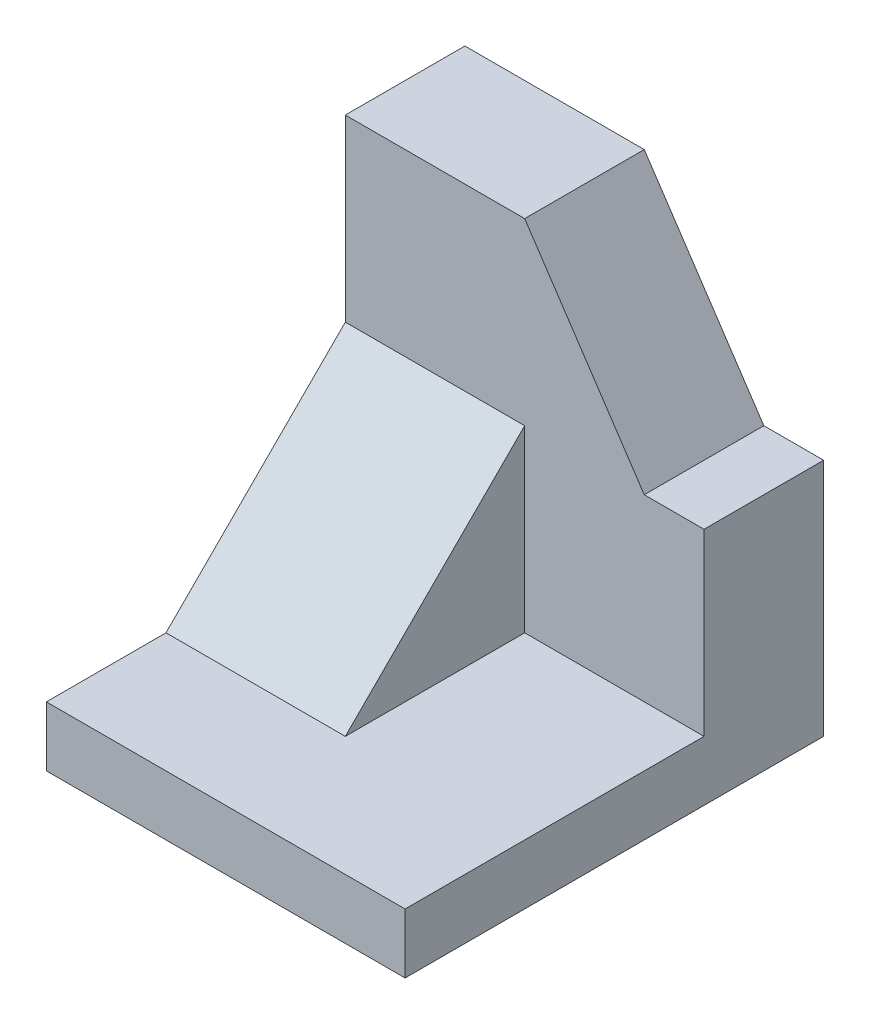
ISO-10303-21;
HEADER;
FILE_DESCRIPTION(('STEP AP214'),'2;1');
FILE_NAME('part.step','',(''),(''),'','','');
FILE_SCHEMA(('AUTOMOTIVE_DESIGN { 1 0 10303 214 1 1 1 1 }'));
ENDSEC;
DATA;
#1=APPLICATION_CONTEXT('core data for automotive mechanical design processes');
#2=APPLICATION_PROTOCOL_DEFINITION('international standard','automotive_design',2000,#1);
#3=PRODUCT_CONTEXT('',#1,'mechanical');
#4=PRODUCT('Part','Part','',(#3));
#5=PRODUCT_RELATED_PRODUCT_CATEGORY('part','',(#4));
#6=PRODUCT_DEFINITION_FORMATION('','',#4);
#7=PRODUCT_DEFINITION_CONTEXT('part definition',#1,'design');
#8=PRODUCT_DEFINITION('design','',#6,#7);
#9=PRODUCT_DEFINITION_SHAPE('','',#8);
#10=(LENGTH_UNIT() NAMED_UNIT(*) SI_UNIT(.MILLI.,.METRE.));
#11=(NAMED_UNIT(*) PLANE_ANGLE_UNIT() SI_UNIT($,.RADIAN.));
#12=(NAMED_UNIT(*) SI_UNIT($,.STERADIAN.) SOLID_ANGLE_UNIT());
#13=UNCERTAINTY_MEASURE_WITH_UNIT(LENGTH_MEASURE(1.E-05),#10,'distance_accuracy_value','');
#14=(GEOMETRIC_REPRESENTATION_CONTEXT(3) GLOBAL_UNCERTAINTY_ASSIGNED_CONTEXT((#13)) GLOBAL_UNIT_ASSIGNED_CONTEXT((#10,
#11,#12)) REPRESENTATION_CONTEXT('',''));
#15=CARTESIAN_POINT('',(0.,0.,0.));
#16=DIRECTION('',(0.,0.,1.));
#17=DIRECTION('',(1.,0.,0.));
#18=AXIS2_PLACEMENT_3D('',#15,#16,#17);
#19=CARTESIAN_POINT('',(-30.,35.,35.));
#20=DIRECTION('',(1.,0.,0.));
#21=DIRECTION('',(0.,1.,0.));
#22=AXIS2_PLACEMENT_3D('',#19,#20,#21);
#23=PLANE('',#22);
#24=DIRECTION('',(0.,0.707106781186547,-0.707106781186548));
#25=VECTOR('',#24,1.);
#26=CARTESIAN_POINT('',(-30.,-25.,15.));
#27=LINE('',#26,#25);
#28=CARTESIAN_POINT('',(-30.,-25.,15.));
#29=VERTEX_POINT('',#28);
#30=CARTESIAN_POINT('',(-30.,5.,-15.));
#31=VERTEX_POINT('',#30);
#32=EDGE_CURVE('E160',#29,#31,#27,.T.);
#33=ORIENTED_EDGE('',*,*,#32,.T.);
#34=DIRECTION('',(0.,1.,0.));
#35=VECTOR('',#34,1.);
#36=CARTESIAN_POINT('',(-30.,35.,-15.));
#37=LINE('',#36,#35);
#38=CARTESIAN_POINT('',(-30.,35.,-15.));
#39=VERTEX_POINT('',#38);
#40=EDGE_CURVE('E94',#31,#39,#37,.T.);
#41=ORIENTED_EDGE('',*,*,#40,.T.);
#42=DIRECTION('',(0.,0.,-1.));
#43=VECTOR('',#42,1.);
#44=CARTESIAN_POINT('',(-30.,35.,35.));
#45=LINE('',#44,#43);
#46=CARTESIAN_POINT('',(-30.,35.,-35.));
#47=VERTEX_POINT('',#46);
#48=EDGE_CURVE('E77',#39,#47,#45,.T.);
#49=ORIENTED_EDGE('',*,*,#48,.T.);
#50=DIRECTION('',(0.,-1.,0.));
#51=VECTOR('',#50,1.);
#52=CARTESIAN_POINT('',(-30.,35.,-35.));
#53=LINE('',#52,#51);
#54=CARTESIAN_POINT('',(-30.,-35.,-35.));
#55=VERTEX_POINT('',#54);
#56=EDGE_CURVE('E92',#47,#55,#53,.T.);
#57=ORIENTED_EDGE('',*,*,#56,.T.);
#58=DIRECTION('',(0.,0.,-1.));
#59=VECTOR('',#58,1.);
#60=CARTESIAN_POINT('',(-30.,-35.,35.));
#61=LINE('',#60,#59);
#62=CARTESIAN_POINT('',(-30.,-35.,35.));
#63=VERTEX_POINT('',#62);
#64=EDGE_CURVE('E114',#63,#55,#61,.T.);
#65=ORIENTED_EDGE('',*,*,#64,.F.);
#66=DIRECTION('',(0.,-1.,0.));
#67=VECTOR('',#66,1.);
#68=CARTESIAN_POINT('',(-30.,35.,35.));
#69=LINE('',#68,#67);
#70=CARTESIAN_POINT('',(-30.,-25.,35.));
#71=VERTEX_POINT('',#70);
#72=EDGE_CURVE('E84',#71,#63,#69,.T.);
#73=ORIENTED_EDGE('',*,*,#72,.F.);
#74=DIRECTION('',(0.,0.,-1.));
#75=VECTOR('',#74,1.);
#76=CARTESIAN_POINT('',(-30.,-25.,35.));
#77=LINE('',#76,#75);
#78=EDGE_CURVE('E157',#71,#29,#77,.T.);
#79=ORIENTED_EDGE('',*,*,#78,.T.);
#80=EDGE_LOOP('',(#33,#41,#49,#57,#65,#73,#79));
#81=FACE_BOUND('',#80,.T.);
#82=ADVANCED_FACE('F33',(#81),#23,.F.);
#83=CARTESIAN_POINT('',(-30.,-35.,35.));
#84=DIRECTION('',(0.,1.,0.));
#85=DIRECTION('',(0.,0.,1.));
#86=AXIS2_PLACEMENT_3D('',#83,#84,#85);
#87=PLANE('',#86);
#88=DIRECTION('',(1.,0.,0.));
#89=VECTOR('',#88,1.);
#90=CARTESIAN_POINT('',(-30.,-35.,-35.));
#91=LINE('',#90,#89);
#92=CARTESIAN_POINT('',(30.,-35.,-35.));
#93=VERTEX_POINT('',#92);
#94=EDGE_CURVE('E100',#55,#93,#91,.T.);
#95=ORIENTED_EDGE('',*,*,#94,.T.);
#96=DIRECTION('',(0.,0.,-1.));
#97=VECTOR('',#96,1.);
#98=CARTESIAN_POINT('',(30.,-35.,35.));
#99=LINE('',#98,#97);
#100=CARTESIAN_POINT('',(30.,-35.,35.));
#101=VERTEX_POINT('',#100);
#102=EDGE_CURVE('E95',#101,#93,#99,.T.);
#103=ORIENTED_EDGE('',*,*,#102,.F.);
#104=DIRECTION('',(1.,0.,0.));
#105=VECTOR('',#104,1.);
#106=CARTESIAN_POINT('',(-30.,-35.,35.));
#107=LINE('',#106,#105);
#108=EDGE_CURVE('E56',#63,#101,#107,.T.);
#109=ORIENTED_EDGE('',*,*,#108,.F.);
#110=ORIENTED_EDGE('',*,*,#64,.T.);
#111=EDGE_LOOP('',(#95,#103,#109,#110));
#112=FACE_BOUND('',#111,.T.);
#113=ADVANCED_FACE('F220',(#112),#87,.F.);
#114=CARTESIAN_POINT('',(30.,35.,35.));
#115=DIRECTION('',(-1.,0.,0.));
#116=DIRECTION('',(0.,-1.,0.));
#117=AXIS2_PLACEMENT_3D('',#114,#115,#116);
#118=PLANE('',#117);
#119=DIRECTION('',(0.,1.,0.));
#120=VECTOR('',#119,1.);
#121=CARTESIAN_POINT('',(30.,35.,-35.));
#122=LINE('',#121,#120);
#123=CARTESIAN_POINT('',(30.,5.,-35.));
#124=VERTEX_POINT('',#123);
#125=EDGE_CURVE('E85',#93,#124,#122,.T.);
#126=ORIENTED_EDGE('',*,*,#125,.T.);
#127=DIRECTION('',(0.,0.,-1.));
#128=VECTOR('',#127,1.);
#129=CARTESIAN_POINT('',(30.,5.,35.));
#130=LINE('',#129,#128);
#131=CARTESIAN_POINT('',(30.,5.,-15.));
#132=VERTEX_POINT('',#131);
#133=EDGE_CURVE('E129',#132,#124,#130,.T.);
#134=ORIENTED_EDGE('',*,*,#133,.F.);
#135=DIRECTION('',(0.,-1.,0.));
#136=VECTOR('',#135,1.);
#137=CARTESIAN_POINT('',(30.,35.,-15.));
#138=LINE('',#137,#136);
#139=CARTESIAN_POINT('',(30.,-25.,-15.));
#140=VERTEX_POINT('',#139);
#141=EDGE_CURVE('E124',#132,#140,#138,.T.);
#142=ORIENTED_EDGE('',*,*,#141,.T.);
#143=DIRECTION('',(0.,0.,1.));
#144=VECTOR('',#143,1.);
#145=CARTESIAN_POINT('',(30.,-25.,35.));
#146=LINE('',#145,#144);
#147=CARTESIAN_POINT('',(30.,-25.,35.));
#148=VERTEX_POINT('',#147);
#149=EDGE_CURVE('E145',#140,#148,#146,.T.);
#150=ORIENTED_EDGE('',*,*,#149,.T.);
#151=DIRECTION('',(0.,1.,0.));
#152=VECTOR('',#151,1.);
#153=CARTESIAN_POINT('',(30.,35.,35.));
#154=LINE('',#153,#152);
#155=EDGE_CURVE('E96',#101,#148,#154,.T.);
#156=ORIENTED_EDGE('',*,*,#155,.F.);
#157=ORIENTED_EDGE('',*,*,#102,.T.);
#158=EDGE_LOOP('',(#126,#134,#142,#150,#156,#157));
#159=FACE_BOUND('',#158,.T.);
#160=ADVANCED_FACE('F133',(#159),#118,.F.);
#161=CARTESIAN_POINT('',(-30.,35.,35.));
#162=DIRECTION('',(0.,-1.,0.));
#163=DIRECTION('',(0.,0.,-1.));
#164=AXIS2_PLACEMENT_3D('',#161,#162,#163);
#165=PLANE('',#164);
#166=DIRECTION('',(1.,0.,0.));
#167=VECTOR('',#166,1.);
#168=CARTESIAN_POINT('',(-30.,35.,-15.));
#169=LINE('',#168,#167);
#170=CARTESIAN_POINT('',(0.,35.,-15.));
#171=VERTEX_POINT('',#170);
#172=EDGE_CURVE('E102',#39,#171,#169,.T.);
#173=ORIENTED_EDGE('',*,*,#172,.T.);
#174=DIRECTION('',(0.,0.,-1.));
#175=VECTOR('',#174,1.);
#176=CARTESIAN_POINT('',(0.,35.,35.));
#177=LINE('',#176,#175);
#178=CARTESIAN_POINT('',(0.,35.,-35.));
#179=VERTEX_POINT('',#178);
#180=EDGE_CURVE('E80',#171,#179,#177,.T.);
#181=ORIENTED_EDGE('',*,*,#180,.T.);
#182=DIRECTION('',(-1.,0.,0.));
#183=VECTOR('',#182,1.);
#184=CARTESIAN_POINT('',(-30.,35.,-35.));
#185=LINE('',#184,#183);
#186=EDGE_CURVE('E73',#179,#47,#185,.T.);
#187=ORIENTED_EDGE('',*,*,#186,.T.);
#188=ORIENTED_EDGE('',*,*,#48,.F.);
#189=EDGE_LOOP('',(#173,#181,#187,#188));
#190=FACE_BOUND('',#189,.T.);
#191=ADVANCED_FACE('F76',(#190),#165,.F.);
#192=CARTESIAN_POINT('',(0.,0.,35.));
#193=DIRECTION('',(0.,0.,1.));
#194=DIRECTION('',(1.,0.,0.));
#195=AXIS2_PLACEMENT_3D('',#192,#193,#194);
#196=PLANE('',#195);
#197=ORIENTED_EDGE('',*,*,#155,.T.);
#198=DIRECTION('',(1.,0.,0.));
#199=VECTOR('',#198,1.);
#200=CARTESIAN_POINT('',(-30.,-25.,35.));
#201=LINE('',#200,#199);
#202=EDGE_CURVE('E163',#71,#148,#201,.T.);
#203=ORIENTED_EDGE('',*,*,#202,.F.);
#204=ORIENTED_EDGE('',*,*,#72,.T.);
#205=ORIENTED_EDGE('',*,*,#108,.T.);
#206=EDGE_LOOP('',(#197,#203,#204,#205));
#207=FACE_BOUND('',#206,.T.);
#208=ADVANCED_FACE('F176',(#207),#196,.T.);
#209=CARTESIAN_POINT('',(0.,0.,-35.));
#210=DIRECTION('',(0.,0.,1.));
#211=DIRECTION('',(1.,0.,0.));
#212=AXIS2_PLACEMENT_3D('',#209,#210,#211);
#213=PLANE('',#212);
#214=ORIENTED_EDGE('',*,*,#186,.F.);
#215=DIRECTION('',(-0.554700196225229,0.832050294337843,0.));
#216=VECTOR('',#215,1.);
#217=CARTESIAN_POINT('',(0.,35.,-35.));
#218=LINE('',#217,#216);
#219=CARTESIAN_POINT('',(20.,5.00000000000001,-35.));
#220=VERTEX_POINT('',#219);
#221=EDGE_CURVE('E136',#220,#179,#218,.T.);
#222=ORIENTED_EDGE('',*,*,#221,.F.);
#223=DIRECTION('',(-1.,0.,0.));
#224=VECTOR('',#223,1.);
#225=CARTESIAN_POINT('',(20.,5.00000000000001,-35.));
#226=LINE('',#225,#224);
#227=EDGE_CURVE('E140',#124,#220,#226,.T.);
#228=ORIENTED_EDGE('',*,*,#227,.F.);
#229=ORIENTED_EDGE('',*,*,#125,.F.);
#230=ORIENTED_EDGE('',*,*,#94,.F.);
#231=ORIENTED_EDGE('',*,*,#56,.F.);
#232=EDGE_LOOP('',(#214,#222,#228,#229,#230,#231));
#233=FACE_BOUND('',#232,.T.);
#234=ADVANCED_FACE('F98',(#233),#213,.F.);
#235=CARTESIAN_POINT('',(-30.,35.,-15.));
#236=DIRECTION('',(0.,0.,-1.));
#237=DIRECTION('',(0.,1.,0.));
#238=AXIS2_PLACEMENT_3D('',#235,#236,#237);
#239=PLANE('',#238);
#240=DIRECTION('',(-1.,0.,0.));
#241=VECTOR('',#240,1.);
#242=CARTESIAN_POINT('',(-30.,5.00000000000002,-15.));
#243=LINE('',#242,#241);
#244=CARTESIAN_POINT('',(20.,5.00000000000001,-15.));
#245=VERTEX_POINT('',#244);
#246=EDGE_CURVE('E40',#132,#245,#243,.T.);
#247=ORIENTED_EDGE('',*,*,#246,.T.);
#248=DIRECTION('',(-0.554700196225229,0.832050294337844,0.));
#249=VECTOR('',#248,1.);
#250=CARTESIAN_POINT('',(-9.23076923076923,48.8461538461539,-15.));
#251=LINE('',#250,#249);
#252=EDGE_CURVE('E11',#245,#171,#251,.T.);
#253=ORIENTED_EDGE('',*,*,#252,.T.);
#254=ORIENTED_EDGE('',*,*,#172,.F.);
#255=ORIENTED_EDGE('',*,*,#40,.F.);
#256=DIRECTION('',(1.,0.,0.));
#257=VECTOR('',#256,1.);
#258=CARTESIAN_POINT('',(-30.,5.,-15.));
#259=LINE('',#258,#257);
#260=CARTESIAN_POINT('',(0.,5.00000000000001,-15.));
#261=VERTEX_POINT('',#260);
#262=EDGE_CURVE('E105',#31,#261,#259,.T.);
#263=ORIENTED_EDGE('',*,*,#262,.T.);
#264=DIRECTION('',(0.,-1.,0.));
#265=VECTOR('',#264,1.);
#266=CARTESIAN_POINT('',(0.,35.,-15.));
#267=LINE('',#266,#265);
#268=CARTESIAN_POINT('',(0.,-25.,-15.));
#269=VERTEX_POINT('',#268);
#270=EDGE_CURVE('E149',#261,#269,#267,.T.);
#271=ORIENTED_EDGE('',*,*,#270,.T.);
#272=DIRECTION('',(-1.,0.,0.));
#273=VECTOR('',#272,1.);
#274=CARTESIAN_POINT('',(30.,-25.,-15.));
#275=LINE('',#274,#273);
#276=EDGE_CURVE('E148',#140,#269,#275,.T.);
#277=ORIENTED_EDGE('',*,*,#276,.F.);
#278=ORIENTED_EDGE('',*,*,#141,.F.);
#279=EDGE_LOOP('',(#247,#253,#254,#255,#263,#271,#277,#278));
#280=FACE_BOUND('',#279,.T.);
#281=ADVANCED_FACE('F118',(#280),#239,.F.);
#282=CARTESIAN_POINT('',(-30.,-25.,15.));
#283=DIRECTION('',(0.,-0.707106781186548,-0.707106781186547));
#284=DIRECTION('',(0.,0.707106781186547,-0.707106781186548));
#285=AXIS2_PLACEMENT_3D('',#282,#283,#284);
#286=PLANE('',#285);
#287=DIRECTION('',(0.,0.707106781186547,-0.707106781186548));
#288=VECTOR('',#287,1.);
#289=CARTESIAN_POINT('',(0.,-25.,15.));
#290=LINE('',#289,#288);
#291=CARTESIAN_POINT('',(0.,-25.,15.));
#292=VERTEX_POINT('',#291);
#293=EDGE_CURVE('E156',#292,#261,#290,.T.);
#294=ORIENTED_EDGE('',*,*,#293,.T.);
#295=ORIENTED_EDGE('',*,*,#262,.F.);
#296=ORIENTED_EDGE('',*,*,#32,.F.);
#297=DIRECTION('',(1.,0.,0.));
#298=VECTOR('',#297,1.);
#299=CARTESIAN_POINT('',(-30.,-25.,15.));
#300=LINE('',#299,#298);
#301=EDGE_CURVE('E168',#29,#292,#300,.T.);
#302=ORIENTED_EDGE('',*,*,#301,.T.);
#303=EDGE_LOOP('',(#294,#295,#296,#302));
#304=FACE_BOUND('',#303,.T.);
#305=ADVANCED_FACE('F238',(#304),#286,.F.);
#306=CARTESIAN_POINT('',(-30.,-25.,35.));
#307=DIRECTION('',(0.,-1.,0.));
#308=DIRECTION('',(0.,0.,-1.));
#309=AXIS2_PLACEMENT_3D('',#306,#307,#308);
#310=PLANE('',#309);
#311=ORIENTED_EDGE('',*,*,#202,.T.);
#312=ORIENTED_EDGE('',*,*,#149,.F.);
#313=ORIENTED_EDGE('',*,*,#276,.T.);
#314=DIRECTION('',(0.,0.,1.));
#315=VECTOR('',#314,1.);
#316=CARTESIAN_POINT('',(0.,-25.,35.));
#317=LINE('',#316,#315);
#318=EDGE_CURVE('E146',#269,#292,#317,.T.);
#319=ORIENTED_EDGE('',*,*,#318,.T.);
#320=ORIENTED_EDGE('',*,*,#301,.F.);
#321=ORIENTED_EDGE('',*,*,#78,.F.);
#322=EDGE_LOOP('',(#311,#312,#313,#319,#320,#321));
#323=FACE_BOUND('',#322,.T.);
#324=ADVANCED_FACE('F183',(#323),#310,.F.);
#325=CARTESIAN_POINT('',(0.,0.,0.));
#326=DIRECTION('',(1.,0.,0.));
#327=DIRECTION('',(0.,0.,-1.));
#328=AXIS2_PLACEMENT_3D('',#325,#326,#327);
#329=PLANE('',#328);
#330=ORIENTED_EDGE('',*,*,#293,.F.);
#331=ORIENTED_EDGE('',*,*,#318,.F.);
#332=ORIENTED_EDGE('',*,*,#270,.F.);
#333=EDGE_LOOP('',(#330,#331,#332));
#334=FACE_BOUND('',#333,.T.);
#335=ADVANCED_FACE('F210',(#334),#329,.T.);
#336=CARTESIAN_POINT('',(0.,35.,35.));
#337=DIRECTION('',(-0.832050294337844,-0.554700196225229,0.));
#338=DIRECTION('',(0.554700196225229,-0.832050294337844,0.));
#339=AXIS2_PLACEMENT_3D('',#336,#337,#338);
#340=PLANE('',#339);
#341=DIRECTION('',(0.,0.,-1.));
#342=VECTOR('',#341,1.);
#343=CARTESIAN_POINT('',(20.,5.00000000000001,35.));
#344=LINE('',#343,#342);
#345=EDGE_CURVE('E47',#245,#220,#344,.T.);
#346=ORIENTED_EDGE('',*,*,#345,.T.);
#347=ORIENTED_EDGE('',*,*,#221,.T.);
#348=ORIENTED_EDGE('',*,*,#180,.F.);
#349=ORIENTED_EDGE('',*,*,#252,.F.);
#350=EDGE_LOOP('',(#346,#347,#348,#349));
#351=FACE_BOUND('',#350,.T.);
#352=ADVANCED_FACE('F203',(#351),#340,.F.);
#353=CARTESIAN_POINT('',(20.,5.00000000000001,35.));
#354=DIRECTION('',(0.,-1.,0.));
#355=DIRECTION('',(1.,0.,0.));
#356=AXIS2_PLACEMENT_3D('',#353,#354,#355);
#357=PLANE('',#356);
#358=ORIENTED_EDGE('',*,*,#133,.T.);
#359=ORIENTED_EDGE('',*,*,#227,.T.);
#360=ORIENTED_EDGE('',*,*,#345,.F.);
#361=ORIENTED_EDGE('',*,*,#246,.F.);
#362=EDGE_LOOP('',(#358,#359,#360,#361));
#363=FACE_BOUND('',#362,.T.);
#364=ADVANCED_FACE('F127',(#363),#357,.F.);
#365=CLOSED_SHELL('',(#82,#113,#160,#191,#208,#234,#281,#305,#324,#335,#352,#364));
#366=MANIFOLD_SOLID_BREP('B2',#365);
#367=ADVANCED_BREP_SHAPE_REPRESENTATION('',(#18,#366),#14);
#368=SHAPE_DEFINITION_REPRESENTATION(#9,#367);
ENDSEC;
END-ISO-10303-21;
